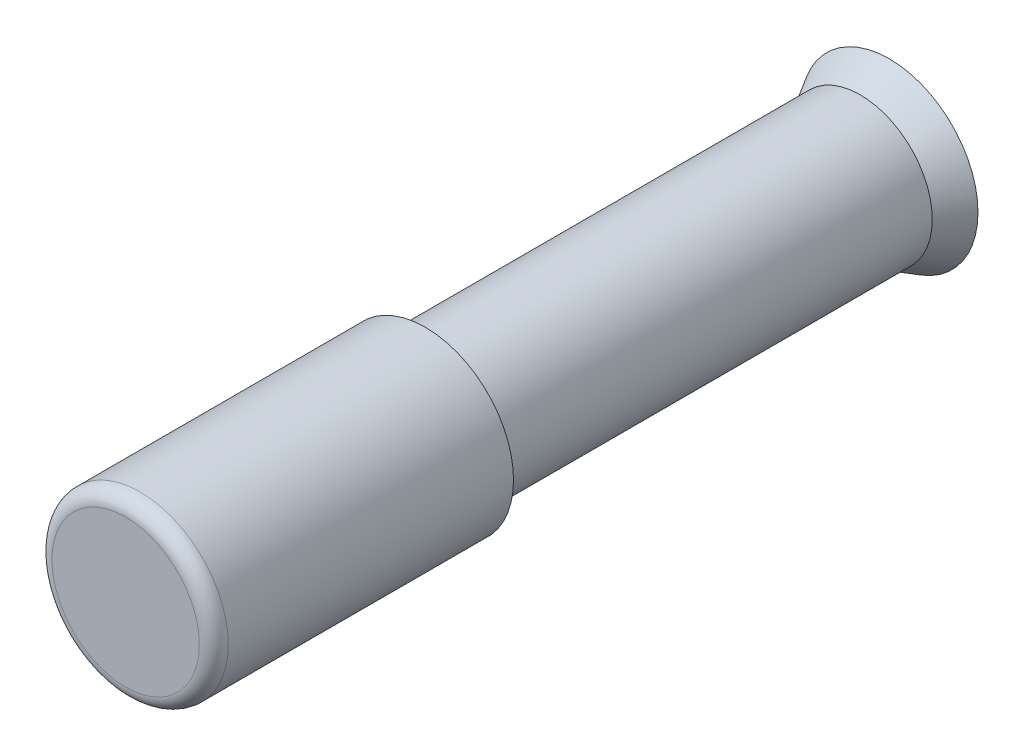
ISO-10303-21;
HEADER;
FILE_DESCRIPTION(('STEP AP214'),'2;1');
FILE_NAME('part.step','',(''),(''),'','','');
FILE_SCHEMA(('AUTOMOTIVE_DESIGN { 1 0 10303 214 1 1 1 1 }'));
ENDSEC;
DATA;
#1=APPLICATION_CONTEXT('core data for automotive mechanical design processes');
#2=APPLICATION_PROTOCOL_DEFINITION('international standard','automotive_design',2000,#1);
#3=PRODUCT_CONTEXT('',#1,'mechanical');
#4=PRODUCT('Part','Part','',(#3));
#5=PRODUCT_RELATED_PRODUCT_CATEGORY('part','',(#4));
#6=PRODUCT_DEFINITION_FORMATION('','',#4);
#7=PRODUCT_DEFINITION_CONTEXT('part definition',#1,'design');
#8=PRODUCT_DEFINITION('design','',#6,#7);
#9=PRODUCT_DEFINITION_SHAPE('','',#8);
#10=(LENGTH_UNIT() NAMED_UNIT(*) SI_UNIT(.MILLI.,.METRE.));
#11=(NAMED_UNIT(*) PLANE_ANGLE_UNIT() SI_UNIT($,.RADIAN.));
#12=(NAMED_UNIT(*) SI_UNIT($,.STERADIAN.) SOLID_ANGLE_UNIT());
#13=UNCERTAINTY_MEASURE_WITH_UNIT(LENGTH_MEASURE(1.E-05),#10,'distance_accuracy_value','');
#14=(GEOMETRIC_REPRESENTATION_CONTEXT(3) GLOBAL_UNCERTAINTY_ASSIGNED_CONTEXT((#13)) GLOBAL_UNIT_ASSIGNED_CONTEXT((#10,
#11,#12)) REPRESENTATION_CONTEXT('',''));
#15=CARTESIAN_POINT('',(0.,0.,0.));
#16=DIRECTION('',(0.,0.,1.));
#17=DIRECTION('',(1.,0.,0.));
#18=AXIS2_PLACEMENT_3D('',#15,#16,#17);
#19=CARTESIAN_POINT('',(0.,0.,0.));
#20=DIRECTION('',(0.,0.,-1.));
#21=DIRECTION('',(-1.,0.,0.));
#22=AXIS2_PLACEMENT_3D('',#19,#20,#21);
#23=PLANE('',#22);
#24=CARTESIAN_POINT('',(0.,0.,0.));
#25=DIRECTION('',(0.,0.,1.));
#26=DIRECTION('',(1.,0.,0.));
#27=AXIS2_PLACEMENT_3D('',#24,#25,#26);
#28=CIRCLE('',#27,2.016125);
#29=CARTESIAN_POINT('',(2.016125,0.,0.));
#30=VERTEX_POINT('',#29);
#31=EDGE_CURVE('E10',#30,#30,#28,.T.);
#32=ORIENTED_EDGE('',*,*,#31,.T.);
#33=EDGE_LOOP('',(#32));
#34=FACE_BOUND('',#33,.T.);
#35=ADVANCED_FACE('F33',(#34),#23,.F.);
#36=CARTESIAN_POINT('',(0.,0.,-0.396875));
#37=DIRECTION('',(0.,0.,1.));
#38=DIRECTION('',(1.,0.,0.));
#39=AXIS2_PLACEMENT_3D('',#36,#37,#38);
#40=TOROIDAL_SURFACE('',#39,2.016125,0.396875);
#41=ORIENTED_EDGE('',*,*,#31,.F.);
#42=EDGE_LOOP('',(#41));
#43=FACE_BOUND('',#42,.T.);
#44=CARTESIAN_POINT('',(0.,0.,-0.396875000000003));
#45=DIRECTION('',(0.,0.,1.));
#46=DIRECTION('',(1.,0.,0.));
#47=AXIS2_PLACEMENT_3D('',#44,#45,#46);
#48=CIRCLE('',#47,2.413);
#49=CARTESIAN_POINT('',(2.413,0.,-0.396875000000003));
#50=VERTEX_POINT('',#49);
#51=EDGE_CURVE('E39',#50,#50,#48,.T.);
#52=ORIENTED_EDGE('',*,*,#51,.T.);
#53=EDGE_LOOP('',(#52));
#54=FACE_BOUND('',#53,.T.);
#55=ADVANCED_FACE('F71',(#43,#54),#40,.T.);
#56=CARTESIAN_POINT('',(0.,0.,0.));
#57=DIRECTION('',(0.,0.,1.));
#58=DIRECTION('',(1.,0.,0.));
#59=AXIS2_PLACEMENT_3D('',#56,#57,#58);
#60=CYLINDRICAL_SURFACE('',#59,2.413);
#61=ORIENTED_EDGE('',*,*,#51,.F.);
#62=EDGE_LOOP('',(#61));
#63=FACE_BOUND('',#62,.T.);
#64=CARTESIAN_POINT('',(0.,0.,-8.2042));
#65=DIRECTION('',(0.,0.,1.));
#66=DIRECTION('',(1.,0.,0.));
#67=AXIS2_PLACEMENT_3D('',#64,#65,#66);
#68=CIRCLE('',#67,2.413);
#69=CARTESIAN_POINT('',(2.413,0.,-8.2042));
#70=VERTEX_POINT('',#69);
#71=EDGE_CURVE('E43',#70,#70,#68,.T.);
#72=ORIENTED_EDGE('',*,*,#71,.T.);
#73=EDGE_LOOP('',(#72));
#74=FACE_BOUND('',#73,.T.);
#75=ADVANCED_FACE('F75',(#63,#74),#60,.T.);
#76=CARTESIAN_POINT('',(0.,2.413,-8.2042));
#77=DIRECTION('',(0.,0.,1.));
#78=DIRECTION('',(1.,0.,0.));
#79=AXIS2_PLACEMENT_3D('',#76,#77,#78);
#80=PLANE('',#79);
#81=ORIENTED_EDGE('',*,*,#71,.F.);
#82=EDGE_LOOP('',(#81));
#83=FACE_BOUND('',#82,.T.);
#84=CARTESIAN_POINT('',(0.,0.,-8.2042));
#85=DIRECTION('',(0.,0.,1.));
#86=DIRECTION('',(1.,0.,0.));
#87=AXIS2_PLACEMENT_3D('',#84,#85,#86);
#88=CIRCLE('',#87,1.9685);
#89=CARTESIAN_POINT('',(1.9685,0.,-8.2042));
#90=VERTEX_POINT('',#89);
#91=EDGE_CURVE('E47',#90,#90,#88,.T.);
#92=ORIENTED_EDGE('',*,*,#91,.T.);
#93=EDGE_LOOP('',(#92));
#94=FACE_BOUND('',#93,.T.);
#95=ADVANCED_FACE('F80',(#83,#94),#80,.F.);
#96=CARTESIAN_POINT('',(0.,0.,0.));
#97=DIRECTION('',(0.,0.,1.));
#98=DIRECTION('',(1.,0.,0.));
#99=AXIS2_PLACEMENT_3D('',#96,#97,#98);
#100=CYLINDRICAL_SURFACE('',#99,1.9685);
#101=ORIENTED_EDGE('',*,*,#91,.F.);
#102=EDGE_LOOP('',(#101));
#103=FACE_BOUND('',#102,.T.);
#104=CARTESIAN_POINT('',(0.,0.,-20.11045));
#105=DIRECTION('',(0.,0.,1.));
#106=DIRECTION('',(1.,0.,0.));
#107=AXIS2_PLACEMENT_3D('',#104,#105,#106);
#108=CIRCLE('',#107,1.9685);
#109=CARTESIAN_POINT('',(1.9685,0.,-20.11045));
#110=VERTEX_POINT('',#109);
#111=EDGE_CURVE('E52',#110,#110,#108,.T.);
#112=ORIENTED_EDGE('',*,*,#111,.T.);
#113=EDGE_LOOP('',(#112));
#114=FACE_BOUND('',#113,.T.);
#115=ADVANCED_FACE('F67',(#103,#114),#100,.T.);
#116=CARTESIAN_POINT('',(0.,0.,-20.9042));
#117=DIRECTION('',(0.,0.,-1.));
#118=DIRECTION('',(-1.,0.,0.));
#119=AXIS2_PLACEMENT_3D('',#116,#117,#118);
#120=CONICAL_SURFACE('',#119,2.42677177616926,0.523598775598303);
#121=ORIENTED_EDGE('',*,*,#111,.F.);
#122=EDGE_LOOP('',(#121));
#123=FACE_BOUND('',#122,.T.);
#124=CARTESIAN_POINT('',(0.,0.,-20.9042));
#125=DIRECTION('',(0.,0.,1.));
#126=DIRECTION('',(1.,0.,0.));
#127=AXIS2_PLACEMENT_3D('',#124,#125,#126);
#128=CIRCLE('',#127,2.42677177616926);
#129=CARTESIAN_POINT('',(2.42677177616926,0.,-20.9042));
#130=VERTEX_POINT('',#129);
#131=EDGE_CURVE('E55',#130,#130,#128,.T.);
#132=ORIENTED_EDGE('',*,*,#131,.T.);
#133=EDGE_LOOP('',(#132));
#134=FACE_BOUND('',#133,.T.);
#135=ADVANCED_FACE('F59',(#123,#134),#120,.T.);
#136=CARTESIAN_POINT('',(0.,0.,-15.0362123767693));
#137=DIRECTION('',(0.,0.,1.));
#138=DIRECTION('',(0.,1.,0.));
#139=AXIS2_PLACEMENT_3D('',#136,#137,#138);
#140=SPHERICAL_SURFACE('',#139,6.35);
#141=ORIENTED_EDGE('',*,*,#131,.F.);
#142=EDGE_LOOP('',(#141));
#143=FACE_BOUND('',#142,.T.);
#144=ADVANCED_FACE('F61',(#143),#140,.T.);
#145=CLOSED_SHELL('',(#35,#55,#75,#95,#115,#135,#144));
#146=MANIFOLD_SOLID_BREP('B2',#145);
#147=ADVANCED_BREP_SHAPE_REPRESENTATION('',(#18,#146),#14);
#148=SHAPE_DEFINITION_REPRESENTATION(#9,#147);
ENDSEC;
END-ISO-10303-21;
